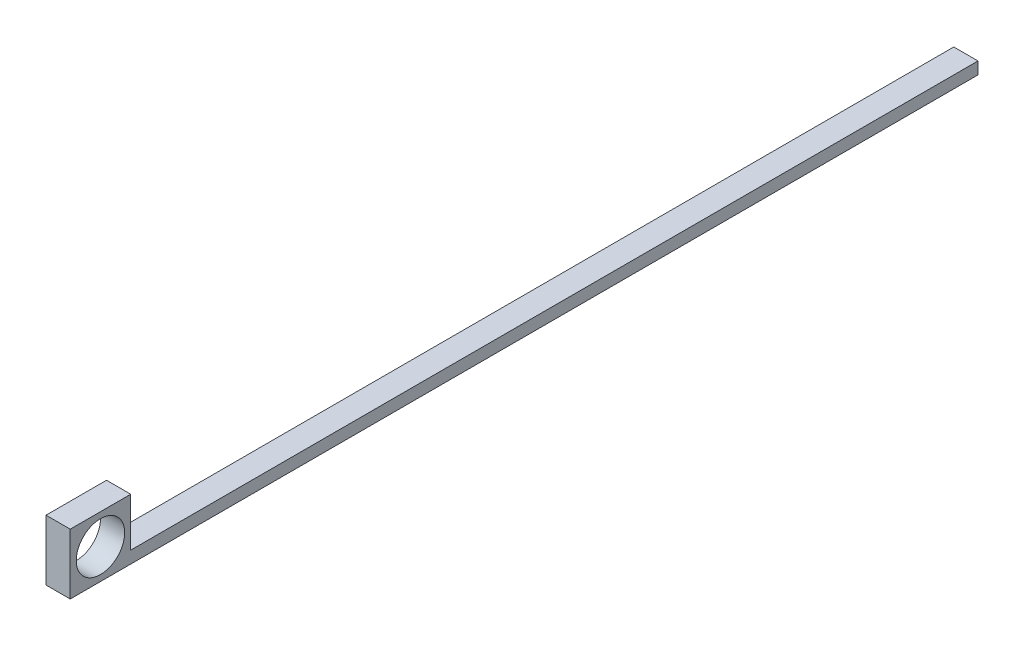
ISO-10303-21;
HEADER;
FILE_DESCRIPTION(('STEP AP214'),'2;1');
FILE_NAME('part.step','',(''),(''),'','','');
FILE_SCHEMA(('AUTOMOTIVE_DESIGN { 1 0 10303 214 1 1 1 1 }'));
ENDSEC;
DATA;
#1=APPLICATION_CONTEXT('core data for automotive mechanical design processes');
#2=APPLICATION_PROTOCOL_DEFINITION('international standard','automotive_design',2000,#1);
#3=PRODUCT_CONTEXT('',#1,'mechanical');
#4=PRODUCT('Part','Part','',(#3));
#5=PRODUCT_RELATED_PRODUCT_CATEGORY('part','',(#4));
#6=PRODUCT_DEFINITION_FORMATION('','',#4);
#7=PRODUCT_DEFINITION_CONTEXT('part definition',#1,'design');
#8=PRODUCT_DEFINITION('design','',#6,#7);
#9=PRODUCT_DEFINITION_SHAPE('','',#8);
#10=(LENGTH_UNIT() NAMED_UNIT(*) SI_UNIT(.MILLI.,.METRE.));
#11=(NAMED_UNIT(*) PLANE_ANGLE_UNIT() SI_UNIT($,.RADIAN.));
#12=(NAMED_UNIT(*) SI_UNIT($,.STERADIAN.) SOLID_ANGLE_UNIT());
#13=UNCERTAINTY_MEASURE_WITH_UNIT(LENGTH_MEASURE(1.E-05),#10,'distance_accuracy_value','');
#14=(GEOMETRIC_REPRESENTATION_CONTEXT(3) GLOBAL_UNCERTAINTY_ASSIGNED_CONTEXT((#13)) GLOBAL_UNIT_ASSIGNED_CONTEXT((#10,
#11,#12)) REPRESENTATION_CONTEXT('',''));
#15=CARTESIAN_POINT('',(0.,0.,0.));
#16=DIRECTION('',(0.,0.,1.));
#17=DIRECTION('',(1.,0.,0.));
#18=AXIS2_PLACEMENT_3D('',#15,#16,#17);
#19=CARTESIAN_POINT('',(20.,0.,-50.));
#20=DIRECTION('',(0.,0.,1.));
#21=DIRECTION('',(1.,0.,0.));
#22=AXIS2_PLACEMENT_3D('',#19,#20,#21);
#23=PLANE('',#22);
#24=DIRECTION('',(1.,0.,0.));
#25=VECTOR('',#24,1.);
#26=CARTESIAN_POINT('',(0.,10.,-50.));
#27=LINE('',#26,#25);
#28=CARTESIAN_POINT('',(0.,10.,-50.));
#29=VERTEX_POINT('',#28);
#30=CARTESIAN_POINT('',(20.,10.,-50.));
#31=VERTEX_POINT('',#30);
#32=EDGE_CURVE('E57',#29,#31,#27,.T.);
#33=ORIENTED_EDGE('',*,*,#32,.F.);
#34=DIRECTION('',(0.,1.,0.));
#35=VECTOR('',#34,1.);
#36=CARTESIAN_POINT('',(0.,0.,-50.));
#37=LINE('',#36,#35);
#38=CARTESIAN_POINT('',(0.,50.,-50.));
#39=VERTEX_POINT('',#38);
#40=EDGE_CURVE('E126',#29,#39,#37,.T.);
#41=ORIENTED_EDGE('',*,*,#40,.T.);
#42=DIRECTION('',(-1.,0.,0.));
#43=VECTOR('',#42,1.);
#44=CARTESIAN_POINT('',(20.,50.,-50.));
#45=LINE('',#44,#43);
#46=CARTESIAN_POINT('',(20.,50.,-50.));
#47=VERTEX_POINT('',#46);
#48=EDGE_CURVE('E49',#47,#39,#45,.T.);
#49=ORIENTED_EDGE('',*,*,#48,.F.);
#50=DIRECTION('',(0.,1.,0.));
#51=VECTOR('',#50,1.);
#52=CARTESIAN_POINT('',(20.,0.,-50.));
#53=LINE('',#52,#51);
#54=EDGE_CURVE('E137',#31,#47,#53,.T.);
#55=ORIENTED_EDGE('',*,*,#54,.F.);
#56=EDGE_LOOP('',(#33,#41,#49,#55));
#57=FACE_BOUND('',#56,.T.);
#58=ADVANCED_FACE('F40',(#57),#23,.F.);
#59=CARTESIAN_POINT('',(20.,0.,0.));
#60=DIRECTION('',(-1.,0.,0.));
#61=DIRECTION('',(0.,0.,1.));
#62=AXIS2_PLACEMENT_3D('',#59,#60,#61);
#63=PLANE('',#62);
#64=DIRECTION('',(0.,-1.,0.));
#65=VECTOR('',#64,1.);
#66=CARTESIAN_POINT('',(20.,0.,0.));
#67=LINE('',#66,#65);
#68=CARTESIAN_POINT('',(20.,50.,0.));
#69=VERTEX_POINT('',#68);
#70=CARTESIAN_POINT('',(20.,0.,0.));
#71=VERTEX_POINT('',#70);
#72=EDGE_CURVE('E147',#69,#71,#67,.T.);
#73=ORIENTED_EDGE('',*,*,#72,.T.);
#74=DIRECTION('',(0.,0.,-1.));
#75=VECTOR('',#74,1.);
#76=CARTESIAN_POINT('',(20.,0.,0.));
#77=LINE('',#76,#75);
#78=CARTESIAN_POINT('',(20.,0.,-750.));
#79=VERTEX_POINT('',#78);
#80=EDGE_CURVE('E88',#71,#79,#77,.T.);
#81=ORIENTED_EDGE('',*,*,#80,.T.);
#82=DIRECTION('',(0.,-1.,0.));
#83=VECTOR('',#82,1.);
#84=CARTESIAN_POINT('',(20.,0.,-750.));
#85=LINE('',#84,#83);
#86=CARTESIAN_POINT('',(20.,10.,-750.));
#87=VERTEX_POINT('',#86);
#88=EDGE_CURVE('E114',#87,#79,#85,.T.);
#89=ORIENTED_EDGE('',*,*,#88,.F.);
#90=DIRECTION('',(0.,0.,1.));
#91=VECTOR('',#90,1.);
#92=CARTESIAN_POINT('',(20.,10.,-750.));
#93=LINE('',#92,#91);
#94=EDGE_CURVE('E110',#87,#31,#93,.T.);
#95=ORIENTED_EDGE('',*,*,#94,.T.);
#96=ORIENTED_EDGE('',*,*,#54,.T.);
#97=DIRECTION('',(0.,0.,1.));
#98=VECTOR('',#97,1.);
#99=CARTESIAN_POINT('',(20.,50.,0.));
#100=LINE('',#99,#98);
#101=EDGE_CURVE('E66',#47,#69,#100,.T.);
#102=ORIENTED_EDGE('',*,*,#101,.T.);
#103=EDGE_LOOP('',(#73,#81,#89,#95,#96,#102));
#104=FACE_BOUND('',#103,.T.);
#105=CARTESIAN_POINT('',(20.,25.,-25.));
#106=DIRECTION('',(1.,0.,0.));
#107=DIRECTION('',(0.,0.,-1.));
#108=AXIS2_PLACEMENT_3D('',#105,#106,#107);
#109=CIRCLE('',#108,20.);
#110=CARTESIAN_POINT('',(20.,25.,-45.));
#111=VERTEX_POINT('',#110);
#112=EDGE_CURVE('E129',#111,#111,#109,.T.);
#113=ORIENTED_EDGE('',*,*,#112,.F.);
#114=EDGE_LOOP('',(#113));
#115=FACE_BOUND('',#114,.T.);
#116=ADVANCED_FACE('F175',(#104,#115),#63,.F.);
#117=CARTESIAN_POINT('',(0.,0.,0.));
#118=DIRECTION('',(-1.,0.,0.));
#119=DIRECTION('',(0.,0.,1.));
#120=AXIS2_PLACEMENT_3D('',#117,#118,#119);
#121=PLANE('',#120);
#122=DIRECTION('',(0.,-1.,0.));
#123=VECTOR('',#122,1.);
#124=CARTESIAN_POINT('',(0.,0.,0.));
#125=LINE('',#124,#123);
#126=CARTESIAN_POINT('',(0.,50.,0.));
#127=VERTEX_POINT('',#126);
#128=CARTESIAN_POINT('',(0.,0.,0.));
#129=VERTEX_POINT('',#128);
#130=EDGE_CURVE('E145',#127,#129,#125,.T.);
#131=ORIENTED_EDGE('',*,*,#130,.F.);
#132=DIRECTION('',(0.,0.,1.));
#133=VECTOR('',#132,1.);
#134=CARTESIAN_POINT('',(0.,50.,0.));
#135=LINE('',#134,#133);
#136=EDGE_CURVE('E82',#39,#127,#135,.T.);
#137=ORIENTED_EDGE('',*,*,#136,.F.);
#138=ORIENTED_EDGE('',*,*,#40,.F.);
#139=DIRECTION('',(0.,0.,1.));
#140=VECTOR('',#139,1.);
#141=CARTESIAN_POINT('',(0.,10.,-750.));
#142=LINE('',#141,#140);
#143=CARTESIAN_POINT('',(0.,10.,-750.));
#144=VERTEX_POINT('',#143);
#145=EDGE_CURVE('E108',#144,#29,#142,.T.);
#146=ORIENTED_EDGE('',*,*,#145,.F.);
#147=DIRECTION('',(0.,1.,0.));
#148=VECTOR('',#147,1.);
#149=CARTESIAN_POINT('',(0.,0.,-750.));
#150=LINE('',#149,#148);
#151=CARTESIAN_POINT('',(0.,0.,-750.));
#152=VERTEX_POINT('',#151);
#153=EDGE_CURVE('E115',#152,#144,#150,.T.);
#154=ORIENTED_EDGE('',*,*,#153,.F.);
#155=DIRECTION('',(0.,0.,-1.));
#156=VECTOR('',#155,1.);
#157=CARTESIAN_POINT('',(0.,0.,0.));
#158=LINE('',#157,#156);
#159=EDGE_CURVE('E155',#129,#152,#158,.T.);
#160=ORIENTED_EDGE('',*,*,#159,.F.);
#161=EDGE_LOOP('',(#131,#137,#138,#146,#154,#160));
#162=FACE_BOUND('',#161,.T.);
#163=CARTESIAN_POINT('',(0.,25.,-25.));
#164=DIRECTION('',(1.,0.,0.));
#165=DIRECTION('',(0.,0.,-1.));
#166=AXIS2_PLACEMENT_3D('',#163,#164,#165);
#167=CIRCLE('',#166,20.);
#168=CARTESIAN_POINT('',(0.,25.,-45.));
#169=VERTEX_POINT('',#168);
#170=EDGE_CURVE('E127',#169,#169,#167,.T.);
#171=ORIENTED_EDGE('',*,*,#170,.T.);
#172=EDGE_LOOP('',(#171));
#173=FACE_BOUND('',#172,.T.);
#174=ADVANCED_FACE('F124',(#162,#173),#121,.T.);
#175=CARTESIAN_POINT('',(20.,0.,0.));
#176=DIRECTION('',(0.,0.,-1.));
#177=DIRECTION('',(-1.,0.,0.));
#178=AXIS2_PLACEMENT_3D('',#175,#176,#177);
#179=PLANE('',#178);
#180=ORIENTED_EDGE('',*,*,#130,.T.);
#181=DIRECTION('',(-1.,0.,0.));
#182=VECTOR('',#181,1.);
#183=CARTESIAN_POINT('',(20.,0.,0.));
#184=LINE('',#183,#182);
#185=EDGE_CURVE('E11',#71,#129,#184,.T.);
#186=ORIENTED_EDGE('',*,*,#185,.F.);
#187=ORIENTED_EDGE('',*,*,#72,.F.);
#188=DIRECTION('',(-1.,0.,0.));
#189=VECTOR('',#188,1.);
#190=CARTESIAN_POINT('',(20.,50.,0.));
#191=LINE('',#190,#189);
#192=EDGE_CURVE('E152',#69,#127,#191,.T.);
#193=ORIENTED_EDGE('',*,*,#192,.T.);
#194=EDGE_LOOP('',(#180,#186,#187,#193));
#195=FACE_BOUND('',#194,.T.);
#196=ADVANCED_FACE('F42',(#195),#179,.F.);
#197=CARTESIAN_POINT('',(20.,0.,0.));
#198=DIRECTION('',(0.,1.,0.));
#199=DIRECTION('',(0.,0.,1.));
#200=AXIS2_PLACEMENT_3D('',#197,#198,#199);
#201=PLANE('',#200);
#202=ORIENTED_EDGE('',*,*,#159,.T.);
#203=DIRECTION('',(-1.,0.,0.));
#204=VECTOR('',#203,1.);
#205=CARTESIAN_POINT('',(0.,0.,-750.));
#206=LINE('',#205,#204);
#207=EDGE_CURVE('E120',#79,#152,#206,.T.);
#208=ORIENTED_EDGE('',*,*,#207,.F.);
#209=ORIENTED_EDGE('',*,*,#80,.F.);
#210=ORIENTED_EDGE('',*,*,#185,.T.);
#211=EDGE_LOOP('',(#202,#208,#209,#210));
#212=FACE_BOUND('',#211,.T.);
#213=ADVANCED_FACE('F164',(#212),#201,.F.);
#214=CARTESIAN_POINT('',(20.,50.,0.));
#215=DIRECTION('',(0.,-1.,0.));
#216=DIRECTION('',(0.,0.,-1.));
#217=AXIS2_PLACEMENT_3D('',#214,#215,#216);
#218=PLANE('',#217);
#219=ORIENTED_EDGE('',*,*,#136,.T.);
#220=ORIENTED_EDGE('',*,*,#192,.F.);
#221=ORIENTED_EDGE('',*,*,#101,.F.);
#222=ORIENTED_EDGE('',*,*,#48,.T.);
#223=EDGE_LOOP('',(#219,#220,#221,#222));
#224=FACE_BOUND('',#223,.T.);
#225=ADVANCED_FACE('F166',(#224),#218,.F.);
#226=CARTESIAN_POINT('',(20.,25.,-25.));
#227=DIRECTION('',(-1.,0.,0.));
#228=DIRECTION('',(0.,0.,1.));
#229=AXIS2_PLACEMENT_3D('',#226,#227,#228);
#230=CYLINDRICAL_SURFACE('',#229,20.);
#231=ORIENTED_EDGE('',*,*,#112,.T.);
#232=EDGE_LOOP('',(#231));
#233=FACE_BOUND('',#232,.T.);
#234=ORIENTED_EDGE('',*,*,#170,.F.);
#235=EDGE_LOOP('',(#234));
#236=FACE_BOUND('',#235,.T.);
#237=ADVANCED_FACE('F171',(#233,#236),#230,.F.);
#238=CARTESIAN_POINT('',(0.,10.,-750.));
#239=DIRECTION('',(0.,-1.,0.));
#240=DIRECTION('',(1.,0.,0.));
#241=AXIS2_PLACEMENT_3D('',#238,#239,#240);
#242=PLANE('',#241);
#243=ORIENTED_EDGE('',*,*,#32,.T.);
#244=ORIENTED_EDGE('',*,*,#94,.F.);
#245=DIRECTION('',(1.,0.,0.));
#246=VECTOR('',#245,1.);
#247=CARTESIAN_POINT('',(0.,10.,-750.));
#248=LINE('',#247,#246);
#249=EDGE_CURVE('E104',#144,#87,#248,.T.);
#250=ORIENTED_EDGE('',*,*,#249,.F.);
#251=ORIENTED_EDGE('',*,*,#145,.T.);
#252=EDGE_LOOP('',(#243,#244,#250,#251));
#253=FACE_BOUND('',#252,.T.);
#254=ADVANCED_FACE('F106',(#253),#242,.F.);
#255=CARTESIAN_POINT('',(0.,0.,-750.));
#256=DIRECTION('',(0.,0.,-1.));
#257=DIRECTION('',(-1.,0.,0.));
#258=AXIS2_PLACEMENT_3D('',#255,#256,#257);
#259=PLANE('',#258);
#260=ORIENTED_EDGE('',*,*,#153,.T.);
#261=ORIENTED_EDGE('',*,*,#249,.T.);
#262=ORIENTED_EDGE('',*,*,#88,.T.);
#263=ORIENTED_EDGE('',*,*,#207,.T.);
#264=EDGE_LOOP('',(#260,#261,#262,#263));
#265=FACE_BOUND('',#264,.T.);
#266=ADVANCED_FACE('F119',(#265),#259,.T.);
#267=CLOSED_SHELL('',(#58,#116,#174,#196,#213,#225,#237,#254,#266));
#268=MANIFOLD_SOLID_BREP('B2',#267);
#269=ADVANCED_BREP_SHAPE_REPRESENTATION('',(#18,#268),#14);
#270=SHAPE_DEFINITION_REPRESENTATION(#9,#269);
ENDSEC;
END-ISO-10303-21;
